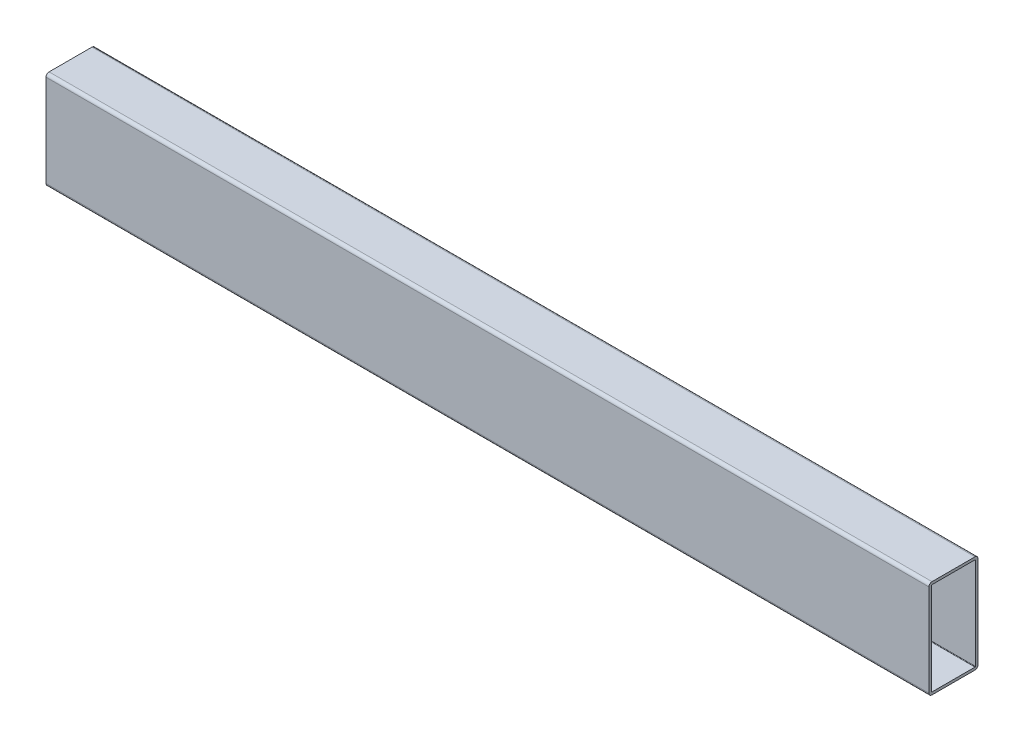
from build123d import *

# Parameters (mm, degrees)
EXTRUDE1_DEPTH = 457.2


with BuildPart() as part:
    # Sketch1 → Extrude1 (new body)
    with BuildSketch(Plane(origin=(0, 0, 0), x_dir=(0, 0, -1), z_dir=(1, 0, 0))):
        with BuildLine():
            Line((-5.373037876, 5.244240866), (16.851962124, 5.244240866))
            ThreePointArc((16.851962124, 5.244240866), (17.974494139, 4.779272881), (18.439462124, 3.656740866))
            Line((18.439462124, 3.656740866), (18.439462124, -43.968259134))
            ThreePointArc((18.439462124, -43.968259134), (17.974494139, -45.090791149), (16.851962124, -45.555759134))
            Line((16.851962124, -45.555759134), (-5.373037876, -45.555759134))
            ThreePointArc((-5.373037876, -45.555759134), (-6.495569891, -45.090791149), (-6.960537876, -43.968259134))
            Line((-6.960537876, -43.968259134), (-6.960537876, 3.656740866))
            ThreePointArc((-6.960537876, 3.656740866), (-6.495569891, 4.779272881), (-5.373037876, 5.244240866))
        make_face()
        with BuildLine():
            Line((-5.373037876, 3.898040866), (16.851962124, 3.898040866))
            ThreePointArc((16.851962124, 3.898040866), (17.02258699, 3.827365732), (17.093262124, 3.656740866))
            Line((17.093262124, 3.656740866), (17.093262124, -43.968259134))
            ThreePointArc((17.093262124, -43.968259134), (17.02258699, -44.138884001), (16.851962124, -44.209559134))
            Line((16.851962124, -44.209559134), (-5.373037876, -44.209559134))
            ThreePointArc((-5.373037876, -44.209559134), (-5.543662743, -44.138884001), (-5.614337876, -43.968259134))
            Line((-5.614337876, -43.968259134), (-5.614337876, 3.656740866))
            ThreePointArc((-5.614337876, 3.656740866), (-5.543662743, 3.827365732), (-5.373037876, 3.898040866))
        make_face(mode=Mode.SUBTRACT)
    extrude(amount=EXTRUDE1_DEPTH)


solid = part.part
